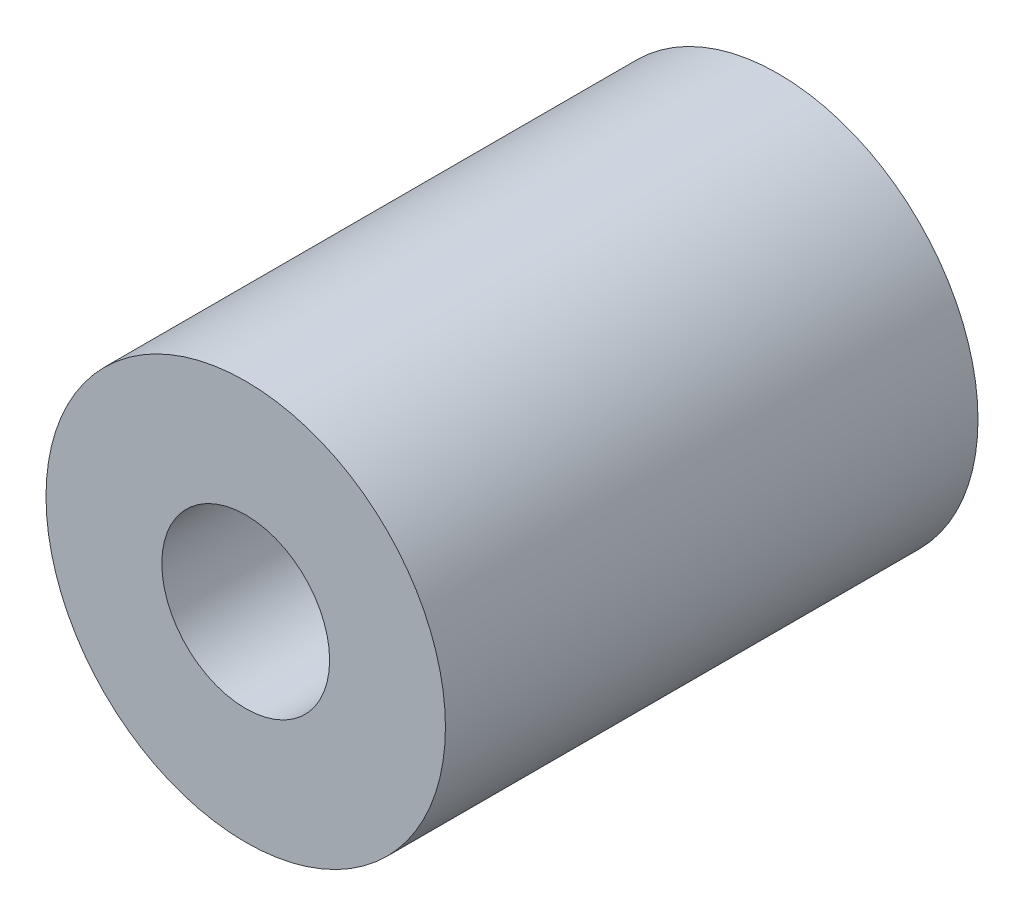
from build123d import *

# Parameters (mm, degrees)
SKETCH1_R           = 9.525
SKETCH1_R_2         = 4.0005
BOSS_EXTRUDE1_DEPTH = 25.4


with BuildPart() as part:
    # Sketch1 → Boss-Extrude1 (new body)
    with BuildSketch(Plane.XY):
        Circle(SKETCH1_R)
        Circle(SKETCH1_R_2, mode=Mode.SUBTRACT)
    extrude(amount=BOSS_EXTRUDE1_DEPTH)


solid = part.part
